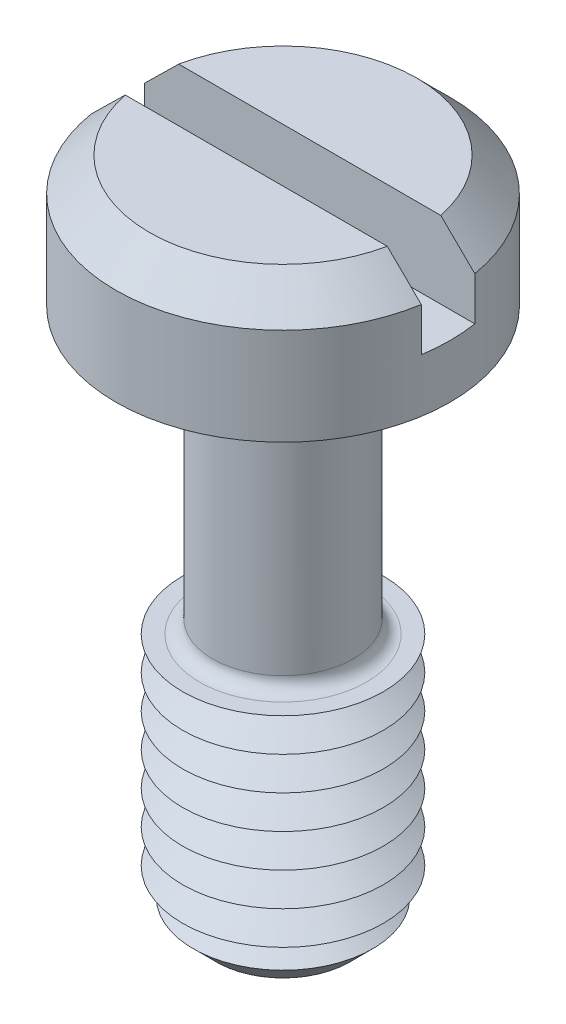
ISO-10303-21;
HEADER;
FILE_DESCRIPTION(('STEP AP214'),'2;1');
FILE_NAME('part.step','',(''),(''),'','','');
FILE_SCHEMA(('AUTOMOTIVE_DESIGN { 1 0 10303 214 1 1 1 1 }'));
ENDSEC;
DATA;
#1=APPLICATION_CONTEXT('core data for automotive mechanical design processes');
#2=APPLICATION_PROTOCOL_DEFINITION('international standard','automotive_design',2000,#1);
#3=PRODUCT_CONTEXT('',#1,'mechanical');
#4=PRODUCT('Part','Part','',(#3));
#5=PRODUCT_RELATED_PRODUCT_CATEGORY('part','',(#4));
#6=PRODUCT_DEFINITION_FORMATION('','',#4);
#7=PRODUCT_DEFINITION_CONTEXT('part definition',#1,'design');
#8=PRODUCT_DEFINITION('design','',#6,#7);
#9=PRODUCT_DEFINITION_SHAPE('','',#8);
#10=(LENGTH_UNIT() NAMED_UNIT(*) SI_UNIT(.MILLI.,.METRE.));
#11=(NAMED_UNIT(*) PLANE_ANGLE_UNIT() SI_UNIT($,.RADIAN.));
#12=(NAMED_UNIT(*) SI_UNIT($,.STERADIAN.) SOLID_ANGLE_UNIT());
#13=UNCERTAINTY_MEASURE_WITH_UNIT(LENGTH_MEASURE(1.E-05),#10,'distance_accuracy_value','');
#14=(GEOMETRIC_REPRESENTATION_CONTEXT(3) GLOBAL_UNCERTAINTY_ASSIGNED_CONTEXT((#13)) GLOBAL_UNIT_ASSIGNED_CONTEXT((#10,
#11,#12)) REPRESENTATION_CONTEXT('',''));
#15=CARTESIAN_POINT('',(0.,0.,0.));
#16=DIRECTION('',(0.,0.,1.));
#17=DIRECTION('',(1.,0.,0.));
#18=AXIS2_PLACEMENT_3D('',#15,#16,#17);
#19=CARTESIAN_POINT('',(0.,3.9,0.));
#20=DIRECTION('',(0.,1.,0.));
#21=DIRECTION('',(0.,0.,1.));
#22=AXIS2_PLACEMENT_3D('',#19,#20,#21);
#23=PLANE('',#22);
#24=DIRECTION('',(-1.,0.,0.));
#25=VECTOR('',#24,1.);
#26=CARTESIAN_POINT('',(5.,3.9,-0.8));
#27=LINE('',#26,#25);
#28=CARTESIAN_POINT('',(3.91918358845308,3.9,-0.8));
#29=VERTEX_POINT('',#28);
#30=CARTESIAN_POINT('',(-3.91918358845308,3.9,-0.8));
#31=VERTEX_POINT('',#30);
#32=EDGE_CURVE('E110',#29,#31,#27,.T.);
#33=ORIENTED_EDGE('',*,*,#32,.F.);
#34=CARTESIAN_POINT('',(0.,3.9,0.));
#35=DIRECTION('',(0.,1.,0.));
#36=DIRECTION('',(0.,0.,1.));
#37=AXIS2_PLACEMENT_3D('',#34,#35,#36);
#38=CIRCLE('',#37,3.99999999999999);
#39=EDGE_CURVE('E113',#29,#31,#38,.T.);
#40=ORIENTED_EDGE('',*,*,#39,.T.);
#41=EDGE_LOOP('',(#33,#40));
#42=FACE_BOUND('',#41,.T.);
#43=ADVANCED_FACE('F39',(#42),#23,.T.);
#44=CARTESIAN_POINT('',(0.,3.9,0.));
#45=DIRECTION('',(0.,-1.,0.));
#46=DIRECTION('',(0.,0.,-1.));
#47=AXIS2_PLACEMENT_3D('',#44,#45,#46);
#48=CONICAL_SURFACE('',#47,3.99999999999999,0.785398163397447);
#49=CARTESIAN_POINT('',(11.0010756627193,-3.13012537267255,-0.8));
#50=CARTESIAN_POINT('',(10.6180645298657,-2.74813121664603,-0.8));
#51=CARTESIAN_POINT('',(10.2350087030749,-2.36618183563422,-0.8));
#52=CARTESIAN_POINT('',(9.46873746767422,-1.60241986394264,-0.8));
#53=CARTESIAN_POINT('',(9.08552205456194,-1.22060727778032,-0.8));
#54=CARTESIAN_POINT('',(8.31861292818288,-0.456918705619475,-0.8));
#55=CARTESIAN_POINT('',(7.93491906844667,-0.0750428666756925,-0.8));
#56=CARTESIAN_POINT('',(7.16722555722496,0.68837857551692,-0.8));
#57=CARTESIAN_POINT('',(6.78322591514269,1.06992418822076,-0.8));
#58=CARTESIAN_POINT('',(6.01856215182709,1.82868912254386,-0.8));
#59=CARTESIAN_POINT('',(5.63790309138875,2.20591354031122,-0.8));
#60=CARTESIAN_POINT('',(5.06622054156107,2.77108317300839,-0.8));
#61=CARTESIAN_POINT('',(4.87553531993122,2.95937045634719,-0.8));
#62=CARTESIAN_POINT('',(4.49384424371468,3.33561647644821,-0.8));
#63=CARTESIAN_POINT('',(4.30283839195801,3.52357521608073,-0.8));
#64=CARTESIAN_POINT('',(3.92044271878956,3.89893397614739,-0.8));
#65=CARTESIAN_POINT('',(3.72905310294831,4.08633420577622,-0.8));
#66=CARTESIAN_POINT('',(3.34554223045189,4.46039762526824,-0.8));
#67=CARTESIAN_POINT('',(3.15342094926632,4.64706078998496,-0.8));
#68=CARTESIAN_POINT('',(2.76802565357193,5.01913697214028,-0.8));
#69=CARTESIAN_POINT('',(2.57475182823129,5.20455018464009,-0.8));
#70=CARTESIAN_POINT('',(2.28318236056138,5.48091108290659,-0.8));
#71=CARTESIAN_POINT('',(2.1857187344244,5.57273577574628,-0.8));
#72=CARTESIAN_POINT('',(1.98998431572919,5.75552004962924,-0.8));
#73=CARTESIAN_POINT('',(1.89171354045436,5.84647964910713,-0.8));
#74=CARTESIAN_POINT('',(1.76578543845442,5.96147491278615,-0.8));
#75=CARTESIAN_POINT('',(1.73869031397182,5.98612635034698,-0.8));
#76=CARTESIAN_POINT('',(1.68439529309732,6.03531372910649,-0.8));
#77=CARTESIAN_POINT('',(1.65719539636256,6.05984966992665,-0.8));
#78=CARTESIAN_POINT('',(1.5754162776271,6.13326356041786,-0.8));
#79=CARTESIAN_POINT('',(1.52066027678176,6.18194515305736,-0.8));
#80=CARTESIAN_POINT('',(1.41038257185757,6.27874171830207,-0.8));
#81=CARTESIAN_POINT('',(1.35485918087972,6.32685477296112,-0.8));
#82=CARTESIAN_POINT('',(1.24299231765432,6.42210730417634,-0.8));
#83=CARTESIAN_POINT('',(1.18664895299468,6.46924690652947,-0.8));
#84=CARTESIAN_POINT('',(1.07845249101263,6.55754663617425,-0.8));
#85=CARTESIAN_POINT('',(1.02670624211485,6.59883713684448,-0.8));
#86=CARTESIAN_POINT('',(0.921961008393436,6.67979338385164,-0.8));
#87=CARTESIAN_POINT('',(0.868962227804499,6.71945939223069,-0.8));
#88=CARTESIAN_POINT('',(0.761295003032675,6.79630361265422,-0.8));
#89=CARTESIAN_POINT('',(0.706629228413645,6.83348552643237,-0.8));
#90=CARTESIAN_POINT('',(0.594896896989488,6.90399895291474,-0.8));
#91=CARTESIAN_POINT('',(0.537833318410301,6.9373350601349,-0.8));
#92=CARTESIAN_POINT('',(0.428390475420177,6.99356340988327,-0.8));
#93=CARTESIAN_POINT('',(0.376435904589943,7.01726022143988,-0.8));
#94=CARTESIAN_POINT('',(0.269759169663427,7.05717670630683,-0.8));
#95=CARTESIAN_POINT('',(0.215046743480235,7.07342088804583,-0.8));
#96=CARTESIAN_POINT('',(0.11301666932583,7.09332110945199,-0.8));
#97=CARTESIAN_POINT('',(0.0660435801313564,7.09866042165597,-0.8));
#98=CARTESIAN_POINT('',(-0.0280587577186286,7.10088875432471,-0.8));
#99=CARTESIAN_POINT('',(-0.0751877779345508,7.09778705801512,-0.8));
#100=CARTESIAN_POINT('',(-0.180723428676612,7.08192474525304,-0.8));
#101=CARTESIAN_POINT('',(-0.238762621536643,7.06679554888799,-0.8));
#102=CARTESIAN_POINT('',(-0.323499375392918,7.03748409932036,-0.8));
#103=CARTESIAN_POINT('',(-0.351441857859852,7.02656594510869,-0.8));
#104=CARTESIAN_POINT('',(-0.406569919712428,7.00295901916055,-0.8));
#105=CARTESIAN_POINT('',(-0.433755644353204,6.99027059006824,-0.8));
#106=CARTESIAN_POINT('',(-0.504673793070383,6.95489235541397,-0.8));
#107=CARTESIAN_POINT('',(-0.547808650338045,6.93101671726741,-0.8));
#108=CARTESIAN_POINT('',(-0.632566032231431,6.88069648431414,-0.8));
#109=CARTESIAN_POINT('',(-0.674187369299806,6.85424992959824,-0.8));
#110=CARTESIAN_POINT('',(-0.756326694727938,6.79950439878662,-0.8));
#111=CARTESIAN_POINT('',(-0.796841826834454,6.77120117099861,-0.8));
#112=CARTESIAN_POINT('',(-0.876938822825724,6.71329852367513,-0.8));
#113=CARTESIAN_POINT('',(-0.916520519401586,6.68369887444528,-0.8));
#114=CARTESIAN_POINT('',(-1.0346590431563,6.59312324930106,-0.8));
#115=CARTESIAN_POINT('',(-1.11211338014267,6.5307142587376,-0.8));
#116=CARTESIAN_POINT('',(-1.26505454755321,6.40381418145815,-0.8));
#117=CARTESIAN_POINT('',(-1.34054439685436,6.33932667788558,-0.8));
#118=CARTESIAN_POINT('',(-1.48913173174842,6.20997083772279,-0.8));
#119=CARTESIAN_POINT('',(-1.56224816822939,6.14512422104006,-0.8));
#120=CARTESIAN_POINT('',(-1.70765393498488,6.01451044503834,-0.8));
#121=CARTESIAN_POINT('',(-1.77994324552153,5.94874326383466,-0.8));
#122=CARTESIAN_POINT('',(-1.99594639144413,5.75046596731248,-0.8));
#123=CARTESIAN_POINT('',(-2.13877767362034,5.61699583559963,-0.8));
#124=CARTESIAN_POINT('',(-2.42324632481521,5.34853800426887,-0.8));
#125=CARTESIAN_POINT('',(-2.56488247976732,5.21354902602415,-0.8));
#126=CARTESIAN_POINT('',(-2.84730929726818,4.94270932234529,-0.8));
#127=CARTESIAN_POINT('',(-2.9881000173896,4.80685865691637,-0.8));
#128=CARTESIAN_POINT('',(-3.26818763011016,4.53549974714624,-0.8));
#129=CARTESIAN_POINT('',(-3.40748821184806,4.39999530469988,-0.8));
#130=CARTESIAN_POINT('',(-3.6857089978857,4.1285917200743,-0.8));
#131=CARTESIAN_POINT('',(-3.82462919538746,3.99269257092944,-0.8));
#132=CARTESIAN_POINT('',(-4.24087543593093,3.58468153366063,-0.8));
#133=CARTESIAN_POINT('',(-4.51779300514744,3.31215310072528,-0.8));
#134=CARTESIAN_POINT('',(-5.05279381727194,2.7844393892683,-0.8));
#135=CARTESIAN_POINT('',(-5.31091639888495,2.52929393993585,-0.8));
#136=CARTESIAN_POINT('',(-5.82680751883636,2.01864429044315,-0.8));
#137=CARTESIAN_POINT('',(-6.08457605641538,1.76314008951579,-0.8));
#138=CARTESIAN_POINT('',(-6.85760508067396,0.996194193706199,-0.8));
#139=CARTESIAN_POINT('',(-7.37251152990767,0.48439576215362,-0.8));
#140=CARTESIAN_POINT('',(-8.40657233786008,-0.544392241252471,-0.8));
#141=CARTESIAN_POINT('',(-8.92572224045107,-1.06138628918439,-0.8));
#142=CARTESIAN_POINT('',(-9.9636287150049,-2.09560660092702,-0.8));
#143=CARTESIAN_POINT('',(-10.4823853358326,-2.61283281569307,-0.8));
#144=CARTESIAN_POINT('',(-11.0010756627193,-3.13012537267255,-0.8));
#145=B_SPLINE_CURVE_WITH_KNOTS('',3,(#49,#50,#51,#52,#53,#54,#55,#56,#57,#58,#59,#60,#61,#62,
#63,#64,#65,#66,#67,#68,#69,#70,#71,#72,#73,#74,#75,#76,#77,#78,#79,#80,#81,#82,#83,#84,#85,#86,
#87,#88,#89,#90,#91,#92,#93,#94,#95,#96,#97,#98,#99,#100,#101,#102,#103,#104,#105,#106,#107,
#108,#109,#110,#111,#112,#113,#114,#115,#116,#117,#118,#119,#120,#121,#122,#123,#124,#125,#126,
#127,#128,#129,#130,#131,#132,#133,#134,#135,#136,#137,#138,#139,#140,#141,#142,#143,#144),
.UNSPECIFIED.,.F.,.F.,(4,2,2,2,2,2,2,2,2,2,2,2,2,2,2,2,2,2,2,2,2,2,2,2,2,2,2,2,2,2,2,2,2,2,2,2,
2,2,2,2,2,2,2,2,2,2,2,4),(0.,1.62282275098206,3.24569489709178,4.86971791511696,
6.49369278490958,8.10142191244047,8.90535980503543,9.70929063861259,10.5128682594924,
11.3164730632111,12.1199494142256,12.5216659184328,12.9233738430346,13.0332669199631,
13.1431603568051,13.3629580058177,13.5833578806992,13.8037290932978,14.0023112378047,
14.2008612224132,14.3991084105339,14.5971162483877,14.7680800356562,14.9384774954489,
15.0795987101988,15.2205647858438,15.3993585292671,15.4893211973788,15.5792664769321,
15.727032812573,15.8749126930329,16.0231439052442,16.1714014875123,16.4697244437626,
16.767558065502,17.0607348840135,17.35391868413,17.9403574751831,18.5273336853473,
19.1142694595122,19.6972736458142,20.2802881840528,21.4458742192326,22.5346981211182,
23.6235243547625,25.8015035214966,27.9995014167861,30.1971550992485),.UNSPECIFIED.);
#146=CARTESIAN_POINT('',(4.93558507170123,2.89999999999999,-0.8));
#147=VERTEX_POINT('',#146);
#148=EDGE_CURVE('E252',#147,#29,#145,.T.);
#149=ORIENTED_EDGE('',*,*,#148,.F.);
#150=CARTESIAN_POINT('',(0.,2.89999999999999,0.));
#151=DIRECTION('',(0.,1.,0.));
#152=DIRECTION('',(0.,0.,1.));
#153=AXIS2_PLACEMENT_3D('',#150,#151,#152);
#154=CIRCLE('',#153,5.);
#155=CARTESIAN_POINT('',(-4.93558507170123,2.89999999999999,-0.8));
#156=VERTEX_POINT('',#155);
#157=EDGE_CURVE('E128',#156,#147,#154,.F.);
#158=ORIENTED_EDGE('',*,*,#157,.F.);
#159=EDGE_CURVE('E102',#31,#156,#145,.T.);
#160=ORIENTED_EDGE('',*,*,#159,.F.);
#161=ORIENTED_EDGE('',*,*,#39,.F.);
#162=EDGE_LOOP('',(#149,#158,#160,#161));
#163=FACE_BOUND('',#162,.T.);
#164=ADVANCED_FACE('F214',(#163),#48,.T.);
#165=CARTESIAN_POINT('',(0.,-16.,0.));
#166=DIRECTION('',(0.,1.,0.));
#167=DIRECTION('',(0.,0.,1.));
#168=AXIS2_PLACEMENT_3D('',#165,#166,#167);
#169=CYLINDRICAL_SURFACE('',#168,2.1);
#170=CARTESIAN_POINT('',(0.,-8.1,0.));
#171=DIRECTION('',(0.,-1.,0.));
#172=DIRECTION('',(0.,0.,-1.));
#173=AXIS2_PLACEMENT_3D('',#170,#171,#172);
#174=CIRCLE('',#173,2.1);
#175=CARTESIAN_POINT('',(0.,-8.1,-2.1));
#176=VERTEX_POINT('',#175);
#177=EDGE_CURVE('E123',#176,#176,#174,.F.);
#178=ORIENTED_EDGE('',*,*,#177,.T.);
#179=EDGE_LOOP('',(#178));
#180=FACE_BOUND('',#179,.T.);
#181=CARTESIAN_POINT('',(0.,-0.399999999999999,0.));
#182=DIRECTION('',(0.,1.,0.));
#183=DIRECTION('',(0.,0.,1.));
#184=AXIS2_PLACEMENT_3D('',#181,#182,#183);
#185=CIRCLE('',#184,2.1);
#186=CARTESIAN_POINT('',(0.,-0.399999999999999,2.1));
#187=VERTEX_POINT('',#186);
#188=EDGE_CURVE('E351',#187,#187,#185,.F.);
#189=ORIENTED_EDGE('',*,*,#188,.T.);
#190=EDGE_LOOP('',(#189));
#191=FACE_BOUND('',#190,.T.);
#192=ADVANCED_FACE('F210',(#180,#191),#169,.T.);
#193=CARTESIAN_POINT('',(0.,3.9,0.));
#194=DIRECTION('',(0.,-1.,0.));
#195=DIRECTION('',(0.,0.,-1.));
#196=AXIS2_PLACEMENT_3D('',#193,#194,#195);
#197=CYLINDRICAL_SURFACE('',#196,5.);
#198=ORIENTED_EDGE('',*,*,#157,.T.);
#199=DIRECTION('',(0.,-1.,0.));
#200=VECTOR('',#199,1.);
#201=CARTESIAN_POINT('',(4.93558507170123,3.9,-0.8));
#202=LINE('',#201,#200);
#203=CARTESIAN_POINT('',(4.93558507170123,1.6,-0.8));
#204=VERTEX_POINT('',#203);
#205=EDGE_CURVE('E64',#147,#204,#202,.T.);
#206=ORIENTED_EDGE('',*,*,#205,.T.);
#207=CARTESIAN_POINT('',(0.,1.6,0.));
#208=DIRECTION('',(0.,1.,0.));
#209=DIRECTION('',(0.,0.,1.));
#210=AXIS2_PLACEMENT_3D('',#207,#208,#209);
#211=CIRCLE('',#210,5.);
#212=CARTESIAN_POINT('',(4.93558507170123,1.6,0.8));
#213=VERTEX_POINT('',#212);
#214=EDGE_CURVE('E11',#213,#204,#211,.T.);
#215=ORIENTED_EDGE('',*,*,#214,.F.);
#216=DIRECTION('',(0.,-1.,0.));
#217=VECTOR('',#216,1.);
#218=CARTESIAN_POINT('',(4.93558507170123,3.9,0.8));
#219=LINE('',#218,#217);
#220=CARTESIAN_POINT('',(4.93558507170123,2.89999999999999,0.8));
#221=VERTEX_POINT('',#220);
#222=EDGE_CURVE('E270',#213,#221,#219,.F.);
#223=ORIENTED_EDGE('',*,*,#222,.T.);
#224=CARTESIAN_POINT('',(-4.93558507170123,2.89999999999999,0.8));
#225=VERTEX_POINT('',#224);
#226=EDGE_CURVE('E120',#221,#225,#154,.F.);
#227=ORIENTED_EDGE('',*,*,#226,.T.);
#228=DIRECTION('',(0.,-1.,0.));
#229=VECTOR('',#228,1.);
#230=CARTESIAN_POINT('',(-4.93558507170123,3.9,0.8));
#231=LINE('',#230,#229);
#232=CARTESIAN_POINT('',(-4.93558507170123,1.6,0.8));
#233=VERTEX_POINT('',#232);
#234=EDGE_CURVE('E96',#225,#233,#231,.T.);
#235=ORIENTED_EDGE('',*,*,#234,.T.);
#236=CARTESIAN_POINT('',(-4.93558507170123,1.6,-0.8));
#237=VERTEX_POINT('',#236);
#238=EDGE_CURVE('E44',#237,#233,#211,.T.);
#239=ORIENTED_EDGE('',*,*,#238,.F.);
#240=DIRECTION('',(0.,-1.,0.));
#241=VECTOR('',#240,1.);
#242=CARTESIAN_POINT('',(-4.93558507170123,3.9,-0.8));
#243=LINE('',#242,#241);
#244=EDGE_CURVE('E274',#237,#156,#243,.F.);
#245=ORIENTED_EDGE('',*,*,#244,.T.);
#246=EDGE_LOOP('',(#198,#206,#215,#223,#227,#235,#239,#245));
#247=FACE_BOUND('',#246,.T.);
#248=CARTESIAN_POINT('',(0.,0.,0.));
#249=DIRECTION('',(0.,1.,0.));
#250=DIRECTION('',(0.,0.,1.));
#251=AXIS2_PLACEMENT_3D('',#248,#249,#250);
#252=CIRCLE('',#251,5.);
#253=CARTESIAN_POINT('',(0.,0.,5.));
#254=VERTEX_POINT('',#253);
#255=EDGE_CURVE('E338',#254,#254,#252,.T.);
#256=ORIENTED_EDGE('',*,*,#255,.T.);
#257=EDGE_LOOP('',(#256));
#258=FACE_BOUND('',#257,.T.);
#259=ADVANCED_FACE('F213',(#247,#258),#197,.T.);
#260=DIRECTION('',(1.,0.,0.));
#261=VECTOR('',#260,1.);
#262=CARTESIAN_POINT('',(5.,3.9,0.8));
#263=LINE('',#262,#261);
#264=CARTESIAN_POINT('',(-3.91918358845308,3.9,0.8));
#265=VERTEX_POINT('',#264);
#266=CARTESIAN_POINT('',(3.91918358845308,3.9,0.8));
#267=VERTEX_POINT('',#266);
#268=EDGE_CURVE('E56',#265,#267,#263,.T.);
#269=ORIENTED_EDGE('',*,*,#268,.F.);
#270=EDGE_CURVE('E108',#265,#267,#38,.T.);
#271=ORIENTED_EDGE('',*,*,#270,.T.);
#272=EDGE_LOOP('',(#269,#271));
#273=FACE_BOUND('',#272,.T.);
#274=ADVANCED_FACE('F107',(#273),#23,.T.);
#275=CARTESIAN_POINT('',(0.,0.,0.));
#276=DIRECTION('',(0.,1.,0.));
#277=DIRECTION('',(0.,0.,1.));
#278=AXIS2_PLACEMENT_3D('',#275,#276,#277);
#279=PLANE('',#278);
#280=CARTESIAN_POINT('',(0.,0.,0.));
#281=DIRECTION('',(0.,1.,0.));
#282=DIRECTION('',(0.,0.,1.));
#283=AXIS2_PLACEMENT_3D('',#280,#281,#282);
#284=CIRCLE('',#283,2.5);
#285=CARTESIAN_POINT('',(0.,0.,2.5));
#286=VERTEX_POINT('',#285);
#287=EDGE_CURVE('E114',#286,#286,#284,.T.);
#288=ORIENTED_EDGE('',*,*,#287,.T.);
#289=EDGE_LOOP('',(#288));
#290=FACE_BOUND('',#289,.T.);
#291=ORIENTED_EDGE('',*,*,#255,.F.);
#292=EDGE_LOOP('',(#291));
#293=FACE_BOUND('',#292,.T.);
#294=ADVANCED_FACE('F204',(#290,#293),#279,.F.);
#295=CARTESIAN_POINT('',(0.,-8.5,0.));
#296=DIRECTION('',(0.,-1.,0.));
#297=DIRECTION('',(0.,0.,-1.));
#298=AXIS2_PLACEMENT_3D('',#295,#296,#297);
#299=PLANE('',#298);
#300=CARTESIAN_POINT('',(0.,-8.5,0.));
#301=DIRECTION('',(0.,-1.,0.));
#302=DIRECTION('',(0.,0.,-1.));
#303=AXIS2_PLACEMENT_3D('',#300,#301,#302);
#304=CIRCLE('',#303,2.5);
#305=CARTESIAN_POINT('',(0.,-8.5,-2.5));
#306=VERTEX_POINT('',#305);
#307=EDGE_CURVE('E345',#306,#306,#304,.T.);
#308=ORIENTED_EDGE('',*,*,#307,.T.);
#309=EDGE_LOOP('',(#308));
#310=FACE_BOUND('',#309,.T.);
#311=CARTESIAN_POINT('',(0.,-8.5,0.));
#312=DIRECTION('',(0.,1.,0.));
#313=DIRECTION('',(0.,0.,1.));
#314=AXIS2_PLACEMENT_3D('',#311,#312,#313);
#315=CIRCLE('',#314,3.);
#316=CARTESIAN_POINT('',(0.,-8.5,3.));
#317=VERTEX_POINT('',#316);
#318=EDGE_CURVE('E335',#317,#317,#315,.T.);
#319=ORIENTED_EDGE('',*,*,#318,.T.);
#320=EDGE_LOOP('',(#319));
#321=FACE_BOUND('',#320,.T.);
#322=ADVANCED_FACE('F200',(#310,#321),#299,.F.);
#323=CARTESIAN_POINT('',(0.,-9.,0.));
#324=DIRECTION('',(0.,1.,0.));
#325=DIRECTION('',(0.,0.,1.));
#326=AXIS2_PLACEMENT_3D('',#323,#324,#325);
#327=CONICAL_SURFACE('',#326,2.13397459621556,1.0471975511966);
#328=ORIENTED_EDGE('',*,*,#318,.F.);
#329=EDGE_LOOP('',(#328));
#330=FACE_BOUND('',#329,.T.);
#331=CARTESIAN_POINT('',(0.,-9.,0.));
#332=DIRECTION('',(0.,1.,0.));
#333=DIRECTION('',(0.,0.,1.));
#334=AXIS2_PLACEMENT_3D('',#331,#332,#333);
#335=CIRCLE('',#334,2.13397459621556);
#336=CARTESIAN_POINT('',(0.,-9.,2.13397459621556));
#337=VERTEX_POINT('',#336);
#338=EDGE_CURVE('E331',#337,#337,#335,.T.);
#339=ORIENTED_EDGE('',*,*,#338,.T.);
#340=EDGE_LOOP('',(#339));
#341=FACE_BOUND('',#340,.T.);
#342=ADVANCED_FACE('F196',(#330,#341),#327,.T.);
#343=CARTESIAN_POINT('',(0.,-9.5,0.));
#344=DIRECTION('',(0.,-1.,0.));
#345=DIRECTION('',(0.,0.,-1.));
#346=AXIS2_PLACEMENT_3D('',#343,#344,#345);
#347=CONICAL_SURFACE('',#346,3.,1.0471975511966);
#348=ORIENTED_EDGE('',*,*,#338,.F.);
#349=EDGE_LOOP('',(#348));
#350=FACE_BOUND('',#349,.T.);
#351=CARTESIAN_POINT('',(0.,-9.5,0.));
#352=DIRECTION('',(0.,1.,0.));
#353=DIRECTION('',(0.,0.,1.));
#354=AXIS2_PLACEMENT_3D('',#351,#352,#353);
#355=CIRCLE('',#354,3.);
#356=CARTESIAN_POINT('',(0.,-9.5,3.));
#357=VERTEX_POINT('',#356);
#358=EDGE_CURVE('E327',#357,#357,#355,.T.);
#359=ORIENTED_EDGE('',*,*,#358,.T.);
#360=EDGE_LOOP('',(#359));
#361=FACE_BOUND('',#360,.T.);
#362=ADVANCED_FACE('F192',(#350,#361),#347,.T.);
#363=CARTESIAN_POINT('',(0.,-10.,0.));
#364=DIRECTION('',(0.,1.,0.));
#365=DIRECTION('',(0.,0.,1.));
#366=AXIS2_PLACEMENT_3D('',#363,#364,#365);
#367=CONICAL_SURFACE('',#366,2.13397459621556,1.0471975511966);
#368=ORIENTED_EDGE('',*,*,#358,.F.);
#369=EDGE_LOOP('',(#368));
#370=FACE_BOUND('',#369,.T.);
#371=CARTESIAN_POINT('',(0.,-10.,0.));
#372=DIRECTION('',(0.,1.,0.));
#373=DIRECTION('',(0.,0.,1.));
#374=AXIS2_PLACEMENT_3D('',#371,#372,#373);
#375=CIRCLE('',#374,2.13397459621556);
#376=CARTESIAN_POINT('',(0.,-10.,2.13397459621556));
#377=VERTEX_POINT('',#376);
#378=EDGE_CURVE('E323',#377,#377,#375,.T.);
#379=ORIENTED_EDGE('',*,*,#378,.T.);
#380=EDGE_LOOP('',(#379));
#381=FACE_BOUND('',#380,.T.);
#382=ADVANCED_FACE('F188',(#370,#381),#367,.T.);
#383=CARTESIAN_POINT('',(0.,-10.5,0.));
#384=DIRECTION('',(0.,-1.,0.));
#385=DIRECTION('',(0.,0.,-1.));
#386=AXIS2_PLACEMENT_3D('',#383,#384,#385);
#387=CONICAL_SURFACE('',#386,3.,1.0471975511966);
#388=ORIENTED_EDGE('',*,*,#378,.F.);
#389=EDGE_LOOP('',(#388));
#390=FACE_BOUND('',#389,.T.);
#391=CARTESIAN_POINT('',(0.,-10.5,0.));
#392=DIRECTION('',(0.,1.,0.));
#393=DIRECTION('',(0.,0.,1.));
#394=AXIS2_PLACEMENT_3D('',#391,#392,#393);
#395=CIRCLE('',#394,3.);
#396=CARTESIAN_POINT('',(0.,-10.5,3.));
#397=VERTEX_POINT('',#396);
#398=EDGE_CURVE('E319',#397,#397,#395,.T.);
#399=ORIENTED_EDGE('',*,*,#398,.T.);
#400=EDGE_LOOP('',(#399));
#401=FACE_BOUND('',#400,.T.);
#402=ADVANCED_FACE('F184',(#390,#401),#387,.T.);
#403=CARTESIAN_POINT('',(0.,-11.,0.));
#404=DIRECTION('',(0.,1.,0.));
#405=DIRECTION('',(0.,0.,1.));
#406=AXIS2_PLACEMENT_3D('',#403,#404,#405);
#407=CONICAL_SURFACE('',#406,2.13397459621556,1.0471975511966);
#408=ORIENTED_EDGE('',*,*,#398,.F.);
#409=EDGE_LOOP('',(#408));
#410=FACE_BOUND('',#409,.T.);
#411=CARTESIAN_POINT('',(0.,-11.,0.));
#412=DIRECTION('',(0.,1.,0.));
#413=DIRECTION('',(0.,0.,1.));
#414=AXIS2_PLACEMENT_3D('',#411,#412,#413);
#415=CIRCLE('',#414,2.13397459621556);
#416=CARTESIAN_POINT('',(0.,-11.,2.13397459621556));
#417=VERTEX_POINT('',#416);
#418=EDGE_CURVE('E315',#417,#417,#415,.T.);
#419=ORIENTED_EDGE('',*,*,#418,.T.);
#420=EDGE_LOOP('',(#419));
#421=FACE_BOUND('',#420,.T.);
#422=ADVANCED_FACE('F180',(#410,#421),#407,.T.);
#423=CARTESIAN_POINT('',(0.,-11.5,0.));
#424=DIRECTION('',(0.,-1.,0.));
#425=DIRECTION('',(0.,0.,-1.));
#426=AXIS2_PLACEMENT_3D('',#423,#424,#425);
#427=CONICAL_SURFACE('',#426,3.,1.0471975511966);
#428=ORIENTED_EDGE('',*,*,#418,.F.);
#429=EDGE_LOOP('',(#428));
#430=FACE_BOUND('',#429,.T.);
#431=CARTESIAN_POINT('',(0.,-11.5,0.));
#432=DIRECTION('',(0.,1.,0.));
#433=DIRECTION('',(0.,0.,1.));
#434=AXIS2_PLACEMENT_3D('',#431,#432,#433);
#435=CIRCLE('',#434,3.);
#436=CARTESIAN_POINT('',(0.,-11.5,3.));
#437=VERTEX_POINT('',#436);
#438=EDGE_CURVE('E311',#437,#437,#435,.T.);
#439=ORIENTED_EDGE('',*,*,#438,.T.);
#440=EDGE_LOOP('',(#439));
#441=FACE_BOUND('',#440,.T.);
#442=ADVANCED_FACE('F176',(#430,#441),#427,.T.);
#443=CARTESIAN_POINT('',(0.,-12.,0.));
#444=DIRECTION('',(0.,1.,0.));
#445=DIRECTION('',(0.,0.,1.));
#446=AXIS2_PLACEMENT_3D('',#443,#444,#445);
#447=CONICAL_SURFACE('',#446,2.13397459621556,1.0471975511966);
#448=ORIENTED_EDGE('',*,*,#438,.F.);
#449=EDGE_LOOP('',(#448));
#450=FACE_BOUND('',#449,.T.);
#451=CARTESIAN_POINT('',(0.,-12.,0.));
#452=DIRECTION('',(0.,1.,0.));
#453=DIRECTION('',(0.,0.,1.));
#454=AXIS2_PLACEMENT_3D('',#451,#452,#453);
#455=CIRCLE('',#454,2.13397459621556);
#456=CARTESIAN_POINT('',(0.,-12.,2.13397459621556));
#457=VERTEX_POINT('',#456);
#458=EDGE_CURVE('E307',#457,#457,#455,.T.);
#459=ORIENTED_EDGE('',*,*,#458,.T.);
#460=EDGE_LOOP('',(#459));
#461=FACE_BOUND('',#460,.T.);
#462=ADVANCED_FACE('F172',(#450,#461),#447,.T.);
#463=CARTESIAN_POINT('',(0.,-12.5,0.));
#464=DIRECTION('',(0.,-1.,0.));
#465=DIRECTION('',(0.,0.,-1.));
#466=AXIS2_PLACEMENT_3D('',#463,#464,#465);
#467=CONICAL_SURFACE('',#466,3.,1.0471975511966);
#468=ORIENTED_EDGE('',*,*,#458,.F.);
#469=EDGE_LOOP('',(#468));
#470=FACE_BOUND('',#469,.T.);
#471=CARTESIAN_POINT('',(0.,-12.5,0.));
#472=DIRECTION('',(0.,1.,0.));
#473=DIRECTION('',(0.,0.,1.));
#474=AXIS2_PLACEMENT_3D('',#471,#472,#473);
#475=CIRCLE('',#474,3.);
#476=CARTESIAN_POINT('',(0.,-12.5,3.));
#477=VERTEX_POINT('',#476);
#478=EDGE_CURVE('E304',#477,#477,#475,.T.);
#479=ORIENTED_EDGE('',*,*,#478,.T.);
#480=EDGE_LOOP('',(#479));
#481=FACE_BOUND('',#480,.T.);
#482=ADVANCED_FACE('F168',(#470,#481),#467,.T.);
#483=CARTESIAN_POINT('',(0.,-13.,0.));
#484=DIRECTION('',(0.,1.,0.));
#485=DIRECTION('',(0.,0.,1.));
#486=AXIS2_PLACEMENT_3D('',#483,#484,#485);
#487=CONICAL_SURFACE('',#486,2.13397459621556,1.0471975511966);
#488=ORIENTED_EDGE('',*,*,#478,.F.);
#489=EDGE_LOOP('',(#488));
#490=FACE_BOUND('',#489,.T.);
#491=CARTESIAN_POINT('',(0.,-13.,0.));
#492=DIRECTION('',(0.,1.,0.));
#493=DIRECTION('',(0.,0.,1.));
#494=AXIS2_PLACEMENT_3D('',#491,#492,#493);
#495=CIRCLE('',#494,2.13397459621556);
#496=CARTESIAN_POINT('',(0.,-13.,2.13397459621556));
#497=VERTEX_POINT('',#496);
#498=EDGE_CURVE('E300',#497,#497,#495,.T.);
#499=ORIENTED_EDGE('',*,*,#498,.T.);
#500=EDGE_LOOP('',(#499));
#501=FACE_BOUND('',#500,.T.);
#502=ADVANCED_FACE('F164',(#490,#501),#487,.T.);
#503=CARTESIAN_POINT('',(0.,-13.5,0.));
#504=DIRECTION('',(0.,-1.,0.));
#505=DIRECTION('',(0.,0.,-1.));
#506=AXIS2_PLACEMENT_3D('',#503,#504,#505);
#507=CONICAL_SURFACE('',#506,3.,1.0471975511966);
#508=ORIENTED_EDGE('',*,*,#498,.F.);
#509=EDGE_LOOP('',(#508));
#510=FACE_BOUND('',#509,.T.);
#511=CARTESIAN_POINT('',(0.,-13.5,0.));
#512=DIRECTION('',(0.,1.,0.));
#513=DIRECTION('',(0.,0.,1.));
#514=AXIS2_PLACEMENT_3D('',#511,#512,#513);
#515=CIRCLE('',#514,3.);
#516=CARTESIAN_POINT('',(0.,-13.5,3.));
#517=VERTEX_POINT('',#516);
#518=EDGE_CURVE('E296',#517,#517,#515,.T.);
#519=ORIENTED_EDGE('',*,*,#518,.T.);
#520=EDGE_LOOP('',(#519));
#521=FACE_BOUND('',#520,.T.);
#522=ADVANCED_FACE('F160',(#510,#521),#507,.T.);
#523=CARTESIAN_POINT('',(0.,-14.,0.));
#524=DIRECTION('',(0.,1.,0.));
#525=DIRECTION('',(0.,0.,1.));
#526=AXIS2_PLACEMENT_3D('',#523,#524,#525);
#527=CONICAL_SURFACE('',#526,2.13397459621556,1.0471975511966);
#528=ORIENTED_EDGE('',*,*,#518,.F.);
#529=EDGE_LOOP('',(#528));
#530=FACE_BOUND('',#529,.T.);
#531=CARTESIAN_POINT('',(0.,-14.,0.));
#532=DIRECTION('',(0.,1.,0.));
#533=DIRECTION('',(0.,0.,1.));
#534=AXIS2_PLACEMENT_3D('',#531,#532,#533);
#535=CIRCLE('',#534,2.13397459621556);
#536=CARTESIAN_POINT('',(0.,-14.,2.13397459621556));
#537=VERTEX_POINT('',#536);
#538=EDGE_CURVE('E292',#537,#537,#535,.T.);
#539=ORIENTED_EDGE('',*,*,#538,.T.);
#540=EDGE_LOOP('',(#539));
#541=FACE_BOUND('',#540,.T.);
#542=ADVANCED_FACE('F156',(#530,#541),#527,.T.);
#543=CARTESIAN_POINT('',(0.,-14.5,0.));
#544=DIRECTION('',(0.,-1.,0.));
#545=DIRECTION('',(0.,0.,-1.));
#546=AXIS2_PLACEMENT_3D('',#543,#544,#545);
#547=CONICAL_SURFACE('',#546,3.,1.0471975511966);
#548=ORIENTED_EDGE('',*,*,#538,.F.);
#549=EDGE_LOOP('',(#548));
#550=FACE_BOUND('',#549,.T.);
#551=CARTESIAN_POINT('',(0.,-14.5,0.));
#552=DIRECTION('',(0.,1.,0.));
#553=DIRECTION('',(0.,0.,1.));
#554=AXIS2_PLACEMENT_3D('',#551,#552,#553);
#555=CIRCLE('',#554,3.);
#556=CARTESIAN_POINT('',(0.,-14.5,3.));
#557=VERTEX_POINT('',#556);
#558=EDGE_CURVE('E288',#557,#557,#555,.T.);
#559=ORIENTED_EDGE('',*,*,#558,.T.);
#560=EDGE_LOOP('',(#559));
#561=FACE_BOUND('',#560,.T.);
#562=ADVANCED_FACE('F152',(#550,#561),#547,.T.);
#563=CARTESIAN_POINT('',(0.,-15.,0.));
#564=DIRECTION('',(0.,1.,0.));
#565=DIRECTION('',(0.,0.,1.));
#566=AXIS2_PLACEMENT_3D('',#563,#564,#565);
#567=CONICAL_SURFACE('',#566,2.13397459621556,1.0471975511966);
#568=ORIENTED_EDGE('',*,*,#558,.F.);
#569=EDGE_LOOP('',(#568));
#570=FACE_BOUND('',#569,.T.);
#571=CARTESIAN_POINT('',(0.,-15.,0.));
#572=DIRECTION('',(0.,1.,0.));
#573=DIRECTION('',(0.,0.,1.));
#574=AXIS2_PLACEMENT_3D('',#571,#572,#573);
#575=CIRCLE('',#574,2.13397459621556);
#576=CARTESIAN_POINT('',(0.,-15.,2.13397459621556));
#577=VERTEX_POINT('',#576);
#578=EDGE_CURVE('E284',#577,#577,#575,.T.);
#579=ORIENTED_EDGE('',*,*,#578,.T.);
#580=EDGE_LOOP('',(#579));
#581=FACE_BOUND('',#580,.T.);
#582=ADVANCED_FACE('F148',(#570,#581),#567,.T.);
#583=CARTESIAN_POINT('',(0.,-15.5,0.));
#584=DIRECTION('',(0.,-1.,0.));
#585=DIRECTION('',(0.,0.,-1.));
#586=AXIS2_PLACEMENT_3D('',#583,#584,#585);
#587=CONICAL_SURFACE('',#586,3.,1.0471975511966);
#588=CARTESIAN_POINT('',(0.,-15.3169872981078,0.));
#589=DIRECTION('',(0.,-1.,0.));
#590=DIRECTION('',(0.,0.,-1.));
#591=AXIS2_PLACEMENT_3D('',#588,#589,#590);
#592=CIRCLE('',#591,2.68301270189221);
#593=CARTESIAN_POINT('',(0.,-15.3169872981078,-2.68301270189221));
#594=VERTEX_POINT('',#593);
#595=EDGE_CURVE('E291',#594,#594,#592,.F.);
#596=ORIENTED_EDGE('',*,*,#595,.T.);
#597=EDGE_LOOP('',(#596));
#598=FACE_BOUND('',#597,.T.);
#599=ORIENTED_EDGE('',*,*,#578,.F.);
#600=EDGE_LOOP('',(#599));
#601=FACE_BOUND('',#600,.T.);
#602=ADVANCED_FACE('F144',(#598,#601),#587,.T.);
#603=CARTESIAN_POINT('',(0.,-16.,0.));
#604=DIRECTION('',(0.,-1.,0.));
#605=DIRECTION('',(0.,0.,-1.));
#606=AXIS2_PLACEMENT_3D('',#603,#604,#605);
#607=PLANE('',#606);
#608=CARTESIAN_POINT('',(0.,-16.,0.));
#609=DIRECTION('',(0.,-1.,0.));
#610=DIRECTION('',(0.,0.,-1.));
#611=AXIS2_PLACEMENT_3D('',#608,#609,#610);
#612=CIRCLE('',#611,1.99999999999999);
#613=CARTESIAN_POINT('',(0.,-16.,-1.99999999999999));
#614=VERTEX_POINT('',#613);
#615=EDGE_CURVE('E341',#614,#614,#612,.T.);
#616=ORIENTED_EDGE('',*,*,#615,.T.);
#617=EDGE_LOOP('',(#616));
#618=FACE_BOUND('',#617,.T.);
#619=ADVANCED_FACE('F147',(#618),#607,.T.);
#620=CARTESIAN_POINT('',(0.,-16.,0.));
#621=DIRECTION('',(0.,1.,0.));
#622=DIRECTION('',(0.,0.,1.));
#623=AXIS2_PLACEMENT_3D('',#620,#621,#622);
#624=CONICAL_SURFACE('',#623,1.99999999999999,0.785398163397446);
#625=ORIENTED_EDGE('',*,*,#595,.F.);
#626=EDGE_LOOP('',(#625));
#627=FACE_BOUND('',#626,.T.);
#628=ORIENTED_EDGE('',*,*,#615,.F.);
#629=EDGE_LOOP('',(#628));
#630=FACE_BOUND('',#629,.T.);
#631=ADVANCED_FACE('F208',(#627,#630),#624,.T.);
#632=CARTESIAN_POINT('',(0.,-8.1,0.));
#633=DIRECTION('',(0.,-1.,0.));
#634=DIRECTION('',(0.,0.,-1.));
#635=AXIS2_PLACEMENT_3D('',#632,#633,#634);
#636=TOROIDAL_SURFACE('',#635,2.5,0.4);
#637=ORIENTED_EDGE('',*,*,#177,.F.);
#638=EDGE_LOOP('',(#637));
#639=FACE_BOUND('',#638,.T.);
#640=ORIENTED_EDGE('',*,*,#307,.F.);
#641=EDGE_LOOP('',(#640));
#642=FACE_BOUND('',#641,.T.);
#643=ADVANCED_FACE('F226',(#639,#642),#636,.F.);
#644=CARTESIAN_POINT('',(0.,-0.399999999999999,0.));
#645=DIRECTION('',(0.,1.,0.));
#646=DIRECTION('',(0.,0.,1.));
#647=AXIS2_PLACEMENT_3D('',#644,#645,#646);
#648=TOROIDAL_SURFACE('',#647,2.5,0.4);
#649=ORIENTED_EDGE('',*,*,#287,.F.);
#650=EDGE_LOOP('',(#649));
#651=FACE_BOUND('',#650,.T.);
#652=ORIENTED_EDGE('',*,*,#188,.F.);
#653=EDGE_LOOP('',(#652));
#654=FACE_BOUND('',#653,.T.);
#655=ADVANCED_FACE('F229',(#651,#654),#648,.F.);
#656=CARTESIAN_POINT('',(-11.0010756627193,-3.13012537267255,0.8));
#657=CARTESIAN_POINT('',(-10.6180645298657,-2.74813121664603,0.8));
#658=CARTESIAN_POINT('',(-10.2350087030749,-2.36618183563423,0.8));
#659=CARTESIAN_POINT('',(-9.46873746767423,-1.60241986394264,0.8));
#660=CARTESIAN_POINT('',(-9.08552205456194,-1.22060727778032,0.8));
#661=CARTESIAN_POINT('',(-8.31861292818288,-0.456918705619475,0.8));
#662=CARTESIAN_POINT('',(-7.93491906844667,-0.0750428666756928,0.8));
#663=CARTESIAN_POINT('',(-7.16722555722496,0.68837857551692,0.8));
#664=CARTESIAN_POINT('',(-6.78322591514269,1.06992418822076,0.8));
#665=CARTESIAN_POINT('',(-6.01856215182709,1.82868912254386,0.8));
#666=CARTESIAN_POINT('',(-5.63790309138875,2.20591354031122,0.8));
#667=CARTESIAN_POINT('',(-5.06622054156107,2.77108317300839,0.8));
#668=CARTESIAN_POINT('',(-4.87553531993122,2.95937045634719,0.8));
#669=CARTESIAN_POINT('',(-4.49384424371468,3.33561647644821,0.8));
#670=CARTESIAN_POINT('',(-4.30283839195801,3.52357521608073,0.8));
#671=CARTESIAN_POINT('',(-3.92044271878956,3.89893397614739,0.8));
#672=CARTESIAN_POINT('',(-3.72905310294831,4.08633420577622,0.8));
#673=CARTESIAN_POINT('',(-3.34554223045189,4.46039762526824,0.8));
#674=CARTESIAN_POINT('',(-3.15342094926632,4.64706078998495,0.8));
#675=CARTESIAN_POINT('',(-2.76802565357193,5.01913697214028,0.8));
#676=CARTESIAN_POINT('',(-2.57475182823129,5.20455018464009,0.8));
#677=CARTESIAN_POINT('',(-2.28318236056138,5.48091108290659,0.8));
#678=CARTESIAN_POINT('',(-2.1857187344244,5.57273577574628,0.8));
#679=CARTESIAN_POINT('',(-1.98998431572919,5.75552004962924,0.8));
#680=CARTESIAN_POINT('',(-1.89171354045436,5.84647964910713,0.8));
#681=CARTESIAN_POINT('',(-1.76578543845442,5.96147491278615,0.8));
#682=CARTESIAN_POINT('',(-1.73869031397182,5.98612635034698,0.8));
#683=CARTESIAN_POINT('',(-1.68439529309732,6.03531372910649,0.8));
#684=CARTESIAN_POINT('',(-1.65719539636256,6.05984966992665,0.8));
#685=CARTESIAN_POINT('',(-1.5754162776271,6.13326356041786,0.8));
#686=CARTESIAN_POINT('',(-1.52066027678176,6.18194515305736,0.8));
#687=CARTESIAN_POINT('',(-1.41038257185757,6.27874171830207,0.8));
#688=CARTESIAN_POINT('',(-1.35485918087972,6.32685477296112,0.8));
#689=CARTESIAN_POINT('',(-1.24299231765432,6.42210730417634,0.8));
#690=CARTESIAN_POINT('',(-1.18664895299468,6.46924690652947,0.8));
#691=CARTESIAN_POINT('',(-1.07845249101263,6.55754663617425,0.8));
#692=CARTESIAN_POINT('',(-1.02670624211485,6.59883713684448,0.8));
#693=CARTESIAN_POINT('',(-0.921961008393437,6.67979338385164,0.8));
#694=CARTESIAN_POINT('',(-0.868962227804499,6.71945939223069,0.8));
#695=CARTESIAN_POINT('',(-0.761295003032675,6.79630361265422,0.8));
#696=CARTESIAN_POINT('',(-0.706629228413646,6.83348552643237,0.8));
#697=CARTESIAN_POINT('',(-0.594896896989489,6.90399895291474,0.8));
#698=CARTESIAN_POINT('',(-0.537833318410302,6.9373350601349,0.8));
#699=CARTESIAN_POINT('',(-0.428390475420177,6.99356340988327,0.8));
#700=CARTESIAN_POINT('',(-0.376435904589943,7.01726022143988,0.8));
#701=CARTESIAN_POINT('',(-0.269759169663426,7.05717670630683,0.8));
#702=CARTESIAN_POINT('',(-0.215046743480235,7.07342088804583,0.8));
#703=CARTESIAN_POINT('',(-0.11301666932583,7.09332110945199,0.8));
#704=CARTESIAN_POINT('',(-0.0660435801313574,7.09866042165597,0.8));
#705=CARTESIAN_POINT('',(0.0280587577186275,7.10088875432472,0.8));
#706=CARTESIAN_POINT('',(0.0751877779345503,7.09778705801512,0.8));
#707=CARTESIAN_POINT('',(0.180723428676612,7.08192474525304,0.8));
#708=CARTESIAN_POINT('',(0.238762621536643,7.06679554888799,0.8));
#709=CARTESIAN_POINT('',(0.323499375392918,7.03748409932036,0.8));
#710=CARTESIAN_POINT('',(0.351441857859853,7.02656594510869,0.8));
#711=CARTESIAN_POINT('',(0.406569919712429,7.00295901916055,0.8));
#712=CARTESIAN_POINT('',(0.433755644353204,6.99027059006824,0.8));
#713=CARTESIAN_POINT('',(0.504673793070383,6.95489235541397,0.8));
#714=CARTESIAN_POINT('',(0.547808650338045,6.93101671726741,0.8));
#715=CARTESIAN_POINT('',(0.632566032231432,6.88069648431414,0.8));
#716=CARTESIAN_POINT('',(0.674187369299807,6.85424992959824,0.8));
#717=CARTESIAN_POINT('',(0.756326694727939,6.79950439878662,0.8));
#718=CARTESIAN_POINT('',(0.796841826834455,6.77120117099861,0.8));
#719=CARTESIAN_POINT('',(0.876938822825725,6.71329852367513,0.8));
#720=CARTESIAN_POINT('',(0.916520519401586,6.68369887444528,0.8));
#721=CARTESIAN_POINT('',(1.0346590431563,6.59312324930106,0.8));
#722=CARTESIAN_POINT('',(1.11211338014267,6.5307142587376,0.8));
#723=CARTESIAN_POINT('',(1.26505454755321,6.40381418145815,0.8));
#724=CARTESIAN_POINT('',(1.34054439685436,6.33932667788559,0.8));
#725=CARTESIAN_POINT('',(1.48913173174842,6.20997083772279,0.8));
#726=CARTESIAN_POINT('',(1.56224816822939,6.14512422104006,0.8));
#727=CARTESIAN_POINT('',(1.70765393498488,6.01451044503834,0.8));
#728=CARTESIAN_POINT('',(1.77994324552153,5.94874326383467,0.8));
#729=CARTESIAN_POINT('',(1.99594639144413,5.75046596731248,0.8));
#730=CARTESIAN_POINT('',(2.13877767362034,5.61699583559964,0.8));
#731=CARTESIAN_POINT('',(2.4232463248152,5.34853800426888,0.8));
#732=CARTESIAN_POINT('',(2.56488247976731,5.21354902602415,0.8));
#733=CARTESIAN_POINT('',(2.84730929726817,4.9427093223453,0.8));
#734=CARTESIAN_POINT('',(2.98810001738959,4.80685865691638,0.8));
#735=CARTESIAN_POINT('',(3.26818763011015,4.53549974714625,0.8));
#736=CARTESIAN_POINT('',(3.40748821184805,4.39999530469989,0.8));
#737=CARTESIAN_POINT('',(3.68570899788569,4.12859172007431,0.8));
#738=CARTESIAN_POINT('',(3.82462919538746,3.99269257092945,0.8));
#739=CARTESIAN_POINT('',(4.24087543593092,3.58468153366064,0.8));
#740=CARTESIAN_POINT('',(4.51779300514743,3.31215310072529,0.8));
#741=CARTESIAN_POINT('',(5.05279381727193,2.78443938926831,0.8));
#742=CARTESIAN_POINT('',(5.31091639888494,2.52929393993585,0.8));
#743=CARTESIAN_POINT('',(5.82680751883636,2.01864429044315,0.8));
#744=CARTESIAN_POINT('',(6.08457605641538,1.7631400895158,0.8));
#745=CARTESIAN_POINT('',(6.85760508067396,0.996194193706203,0.8));
#746=CARTESIAN_POINT('',(7.37251152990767,0.484395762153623,0.8));
#747=CARTESIAN_POINT('',(8.40657233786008,-0.544392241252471,0.8));
#748=CARTESIAN_POINT('',(8.92572224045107,-1.06138628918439,0.8));
#749=CARTESIAN_POINT('',(9.9636287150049,-2.09560660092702,0.8));
#750=CARTESIAN_POINT('',(10.4823853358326,-2.61283281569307,0.8));
#751=CARTESIAN_POINT('',(11.0010756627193,-3.13012537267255,0.8));
#752=B_SPLINE_CURVE_WITH_KNOTS('',3,(#656,#657,#658,#659,#660,#661,#662,#663,#664,#665,#666,
#667,#668,#669,#670,#671,#672,#673,#674,#675,#676,#677,#678,#679,#680,#681,#682,#683,#684,#685,
#686,#687,#688,#689,#690,#691,#692,#693,#694,#695,#696,#697,#698,#699,#700,#701,#702,#703,#704,
#705,#706,#707,#708,#709,#710,#711,#712,#713,#714,#715,#716,#717,#718,#719,#720,#721,#722,#723,
#724,#725,#726,#727,#728,#729,#730,#731,#732,#733,#734,#735,#736,#737,#738,#739,#740,#741,#742,
#743,#744,#745,#746,#747,#748,#749,#750,#751),.UNSPECIFIED.,.F.,.F.,(4,2,2,2,2,2,2,2,2,2,2,2,2,
2,2,2,2,2,2,2,2,2,2,2,2,2,2,2,2,2,2,2,2,2,2,2,2,2,2,2,2,2,2,2,2,2,2,4),(0.,1.62282275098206,
3.24569489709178,4.86971791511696,6.49369278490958,8.10142191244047,8.90535980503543,
9.70929063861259,10.5128682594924,11.3164730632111,12.1199494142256,12.5216659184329,
12.9233738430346,13.0332669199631,13.1431603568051,13.3629580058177,13.5833578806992,
13.8037290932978,14.0023112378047,14.2008612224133,14.3991084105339,14.5971162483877,
14.7680800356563,14.9384774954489,15.0795987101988,15.2205647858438,15.3993585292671,
15.4893211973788,15.5792664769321,15.727032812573,15.8749126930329,16.0231439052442,
16.1714014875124,16.4697244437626,16.767558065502,17.0607348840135,17.35391868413,
17.9403574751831,18.5273336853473,19.1142694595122,19.6972736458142,20.2802881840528,
21.4458742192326,22.5346981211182,23.6235243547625,25.8015035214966,27.9995014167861,
30.1971550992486),.UNSPECIFIED.);
#753=EDGE_CURVE('E92',#225,#265,#752,.T.);
#754=ORIENTED_EDGE('',*,*,#753,.F.);
#755=ORIENTED_EDGE('',*,*,#226,.F.);
#756=EDGE_CURVE('E103',#267,#221,#752,.T.);
#757=ORIENTED_EDGE('',*,*,#756,.F.);
#758=ORIENTED_EDGE('',*,*,#270,.F.);
#759=EDGE_LOOP('',(#754,#755,#757,#758));
#760=FACE_BOUND('',#759,.T.);
#761=ADVANCED_FACE('F41',(#760),#48,.T.);
#762=CARTESIAN_POINT('',(0.,1.6,0.));
#763=DIRECTION('',(0.,1.,0.));
#764=DIRECTION('',(0.,0.,1.));
#765=AXIS2_PLACEMENT_3D('',#762,#763,#764);
#766=PLANE('',#765);
#767=DIRECTION('',(1.,0.,0.));
#768=VECTOR('',#767,1.);
#769=CARTESIAN_POINT('',(5.,1.6,0.8));
#770=LINE('',#769,#768);
#771=EDGE_CURVE('E249',#233,#213,#770,.T.);
#772=ORIENTED_EDGE('',*,*,#771,.T.);
#773=ORIENTED_EDGE('',*,*,#214,.T.);
#774=DIRECTION('',(-1.,0.,0.));
#775=VECTOR('',#774,1.);
#776=CARTESIAN_POINT('',(5.,1.6,-0.8));
#777=LINE('',#776,#775);
#778=EDGE_CURVE('E267',#204,#237,#777,.T.);
#779=ORIENTED_EDGE('',*,*,#778,.T.);
#780=ORIENTED_EDGE('',*,*,#238,.T.);
#781=EDGE_LOOP('',(#772,#773,#779,#780));
#782=FACE_BOUND('',#781,.T.);
#783=ADVANCED_FACE('F236',(#782),#766,.T.);
#784=CARTESIAN_POINT('',(5.,1.6,-0.8));
#785=DIRECTION('',(0.,0.,-1.));
#786=DIRECTION('',(-1.,0.,0.));
#787=AXIS2_PLACEMENT_3D('',#784,#785,#786);
#788=PLANE('',#787);
#789=ORIENTED_EDGE('',*,*,#148,.T.);
#790=ORIENTED_EDGE('',*,*,#32,.T.);
#791=ORIENTED_EDGE('',*,*,#159,.T.);
#792=ORIENTED_EDGE('',*,*,#244,.F.);
#793=ORIENTED_EDGE('',*,*,#778,.F.);
#794=ORIENTED_EDGE('',*,*,#205,.F.);
#795=EDGE_LOOP('',(#789,#790,#791,#792,#793,#794));
#796=FACE_BOUND('',#795,.T.);
#797=ADVANCED_FACE('F141',(#796),#788,.F.);
#798=CARTESIAN_POINT('',(5.,1.6,0.8));
#799=DIRECTION('',(0.,0.,1.));
#800=DIRECTION('',(1.,0.,0.));
#801=AXIS2_PLACEMENT_3D('',#798,#799,#800);
#802=PLANE('',#801);
#803=ORIENTED_EDGE('',*,*,#753,.T.);
#804=ORIENTED_EDGE('',*,*,#268,.T.);
#805=ORIENTED_EDGE('',*,*,#756,.T.);
#806=ORIENTED_EDGE('',*,*,#222,.F.);
#807=ORIENTED_EDGE('',*,*,#771,.F.);
#808=ORIENTED_EDGE('',*,*,#234,.F.);
#809=EDGE_LOOP('',(#803,#804,#805,#806,#807,#808));
#810=FACE_BOUND('',#809,.T.);
#811=ADVANCED_FACE('F93',(#810),#802,.F.);
#812=CLOSED_SHELL('',(#43,#164,#192,#259,#274,#294,#322,#342,#362,#382,#402,#422,#442,#462,#482,
#502,#522,#542,#562,#582,#602,#619,#631,#643,#655,#761,#783,#797,#811));
#813=MANIFOLD_SOLID_BREP('B2',#812);
#814=ADVANCED_BREP_SHAPE_REPRESENTATION('',(#18,#813),#14);
#815=SHAPE_DEFINITION_REPRESENTATION(#9,#814);
ENDSEC;
END-ISO-10303-21;
